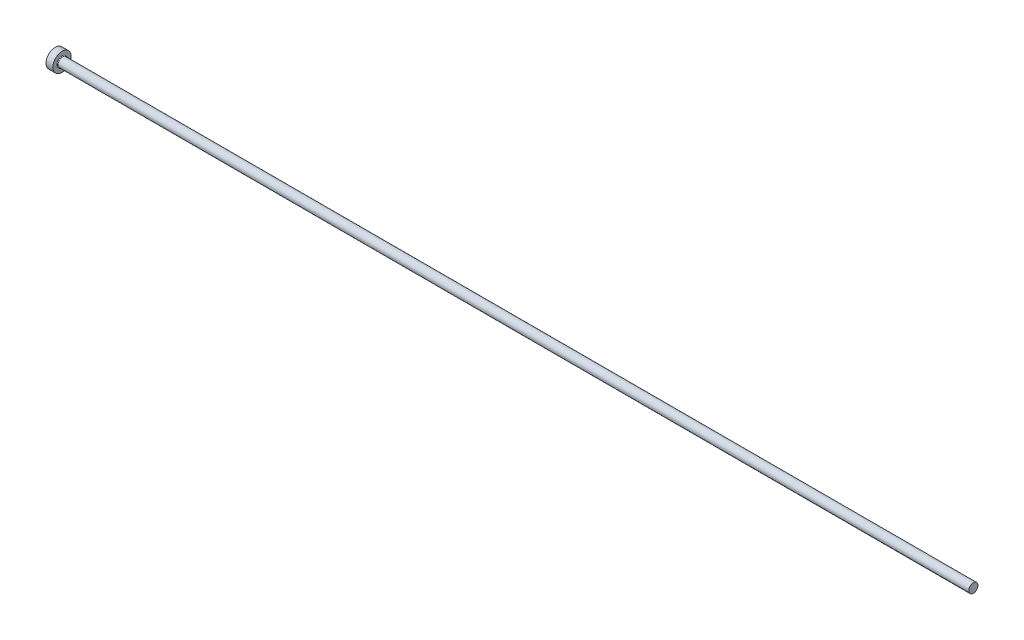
ISO-10303-21;
HEADER;
FILE_DESCRIPTION(('STEP AP214'),'2;1');
FILE_NAME('part.step','',(''),(''),'','','');
FILE_SCHEMA(('AUTOMOTIVE_DESIGN { 1 0 10303 214 1 1 1 1 }'));
ENDSEC;
DATA;
#1=APPLICATION_CONTEXT('core data for automotive mechanical design processes');
#2=APPLICATION_PROTOCOL_DEFINITION('international standard','automotive_design',2000,#1);
#3=PRODUCT_CONTEXT('',#1,'mechanical');
#4=PRODUCT('Part','Part','',(#3));
#5=PRODUCT_RELATED_PRODUCT_CATEGORY('part','',(#4));
#6=PRODUCT_DEFINITION_FORMATION('','',#4);
#7=PRODUCT_DEFINITION_CONTEXT('part definition',#1,'design');
#8=PRODUCT_DEFINITION('design','',#6,#7);
#9=PRODUCT_DEFINITION_SHAPE('','',#8);
#10=(LENGTH_UNIT() NAMED_UNIT(*) SI_UNIT(.MILLI.,.METRE.));
#11=(NAMED_UNIT(*) PLANE_ANGLE_UNIT() SI_UNIT($,.RADIAN.));
#12=(NAMED_UNIT(*) SI_UNIT($,.STERADIAN.) SOLID_ANGLE_UNIT());
#13=UNCERTAINTY_MEASURE_WITH_UNIT(LENGTH_MEASURE(1.E-05),#10,'distance_accuracy_value','');
#14=(GEOMETRIC_REPRESENTATION_CONTEXT(3) GLOBAL_UNCERTAINTY_ASSIGNED_CONTEXT((#13)) GLOBAL_UNIT_ASSIGNED_CONTEXT((#10,
#11,#12)) REPRESENTATION_CONTEXT('',''));
#15=CARTESIAN_POINT('',(0.,0.,0.));
#16=DIRECTION('',(0.,0.,1.));
#17=DIRECTION('',(1.,0.,0.));
#18=AXIS2_PLACEMENT_3D('',#15,#16,#17);
#19=CARTESIAN_POINT('',(0.,0.,0.));
#20=DIRECTION('',(-1.,0.,0.));
#21=DIRECTION('',(0.,-1.,0.));
#22=AXIS2_PLACEMENT_3D('',#19,#20,#21);
#23=PLANE('',#22);
#24=CARTESIAN_POINT('',(0.,0.,0.));
#25=DIRECTION('',(1.,0.,0.));
#26=DIRECTION('',(0.,1.,0.));
#27=AXIS2_PLACEMENT_3D('',#24,#25,#26);
#28=CIRCLE('',#27,4.);
#29=CARTESIAN_POINT('',(0.,4.,0.));
#30=VERTEX_POINT('',#29);
#31=EDGE_CURVE('E25',#30,#30,#28,.T.);
#32=ORIENTED_EDGE('',*,*,#31,.F.);
#33=EDGE_LOOP('',(#32));
#34=FACE_BOUND('',#33,.T.);
#35=ADVANCED_FACE('F14',(#34),#23,.T.);
#36=CARTESIAN_POINT('',(400.,0.,0.));
#37=DIRECTION('',(1.,0.,0.));
#38=DIRECTION('',(0.,1.,0.));
#39=AXIS2_PLACEMENT_3D('',#36,#37,#38);
#40=CYLINDRICAL_SURFACE('',#39,4.);
#41=ORIENTED_EDGE('',*,*,#31,.T.);
#42=EDGE_LOOP('',(#41));
#43=FACE_BOUND('',#42,.T.);
#44=CARTESIAN_POINT('',(3.,0.,0.));
#45=DIRECTION('',(1.,0.,0.));
#46=DIRECTION('',(0.,1.,0.));
#47=AXIS2_PLACEMENT_3D('',#44,#45,#46);
#48=CIRCLE('',#47,4.);
#49=CARTESIAN_POINT('',(3.,4.,0.));
#50=VERTEX_POINT('',#49);
#51=EDGE_CURVE('E29',#50,#50,#48,.T.);
#52=ORIENTED_EDGE('',*,*,#51,.F.);
#53=EDGE_LOOP('',(#52));
#54=FACE_BOUND('',#53,.T.);
#55=ADVANCED_FACE('F51',(#43,#54),#40,.T.);
#56=CARTESIAN_POINT('',(3.,4.,0.));
#57=DIRECTION('',(1.,0.,0.));
#58=DIRECTION('',(0.,1.,0.));
#59=AXIS2_PLACEMENT_3D('',#56,#57,#58);
#60=PLANE('',#59);
#61=CARTESIAN_POINT('',(3.,0.,0.));
#62=DIRECTION('',(1.,0.,0.));
#63=DIRECTION('',(0.,1.,0.));
#64=AXIS2_PLACEMENT_3D('',#61,#62,#63);
#65=CIRCLE('',#64,2.29999999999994);
#66=CARTESIAN_POINT('',(3.,2.29999999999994,0.));
#67=VERTEX_POINT('',#66);
#68=EDGE_CURVE('E9',#67,#67,#65,.F.);
#69=ORIENTED_EDGE('',*,*,#68,.T.);
#70=EDGE_LOOP('',(#69));
#71=FACE_BOUND('',#70,.T.);
#72=ORIENTED_EDGE('',*,*,#51,.T.);
#73=EDGE_LOOP('',(#72));
#74=FACE_BOUND('',#73,.T.);
#75=ADVANCED_FACE('F42',(#71,#74),#60,.T.);
#76=CARTESIAN_POINT('',(400.,0.,0.));
#77=DIRECTION('',(1.,0.,0.));
#78=DIRECTION('',(0.,1.,0.));
#79=AXIS2_PLACEMENT_3D('',#76,#77,#78);
#80=CYLINDRICAL_SURFACE('',#79,1.99999999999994);
#81=CARTESIAN_POINT('',(3.3,0.,0.));
#82=DIRECTION('',(1.,0.,0.));
#83=DIRECTION('',(0.,1.,0.));
#84=AXIS2_PLACEMENT_3D('',#81,#82,#83);
#85=CIRCLE('',#84,1.99999999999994);
#86=CARTESIAN_POINT('',(3.3,1.99999999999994,0.));
#87=VERTEX_POINT('',#86);
#88=EDGE_CURVE('E21',#87,#87,#85,.T.);
#89=ORIENTED_EDGE('',*,*,#88,.T.);
#90=EDGE_LOOP('',(#89));
#91=FACE_BOUND('',#90,.T.);
#92=CARTESIAN_POINT('',(400.,0.,0.));
#93=DIRECTION('',(1.,0.,0.));
#94=DIRECTION('',(0.,1.,0.));
#95=AXIS2_PLACEMENT_3D('',#92,#93,#94);
#96=CIRCLE('',#95,1.99999999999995);
#97=CARTESIAN_POINT('',(400.,1.99999999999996,0.));
#98=VERTEX_POINT('',#97);
#99=EDGE_CURVE('E34',#98,#98,#96,.T.);
#100=ORIENTED_EDGE('',*,*,#99,.F.);
#101=EDGE_LOOP('',(#100));
#102=FACE_BOUND('',#101,.T.);
#103=ADVANCED_FACE('F40',(#91,#102),#80,.T.);
#104=CARTESIAN_POINT('',(400.,1.99999999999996,0.));
#105=DIRECTION('',(1.,0.,0.));
#106=DIRECTION('',(0.,1.,0.));
#107=AXIS2_PLACEMENT_3D('',#104,#105,#106);
#108=PLANE('',#107);
#109=ORIENTED_EDGE('',*,*,#99,.T.);
#110=EDGE_LOOP('',(#109));
#111=FACE_BOUND('',#110,.T.);
#112=ADVANCED_FACE('F38',(#111),#108,.T.);
#113=CARTESIAN_POINT('',(3.3,0.,0.));
#114=DIRECTION('',(1.,0.,0.));
#115=DIRECTION('',(0.,1.,0.));
#116=AXIS2_PLACEMENT_3D('',#113,#114,#115);
#117=TOROIDAL_SURFACE('',#116,2.29999999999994,0.3);
#118=ORIENTED_EDGE('',*,*,#68,.F.);
#119=EDGE_LOOP('',(#118));
#120=FACE_BOUND('',#119,.T.);
#121=ORIENTED_EDGE('',*,*,#88,.F.);
#122=EDGE_LOOP('',(#121));
#123=FACE_BOUND('',#122,.T.);
#124=ADVANCED_FACE('F16',(#120,#123),#117,.F.);
#125=CLOSED_SHELL('',(#35,#55,#75,#103,#112,#124));
#126=MANIFOLD_SOLID_BREP('B1',#125);
#127=ADVANCED_BREP_SHAPE_REPRESENTATION('',(#18,#126),#14);
#128=SHAPE_DEFINITION_REPRESENTATION(#9,#127);
ENDSEC;
END-ISO-10303-21;
